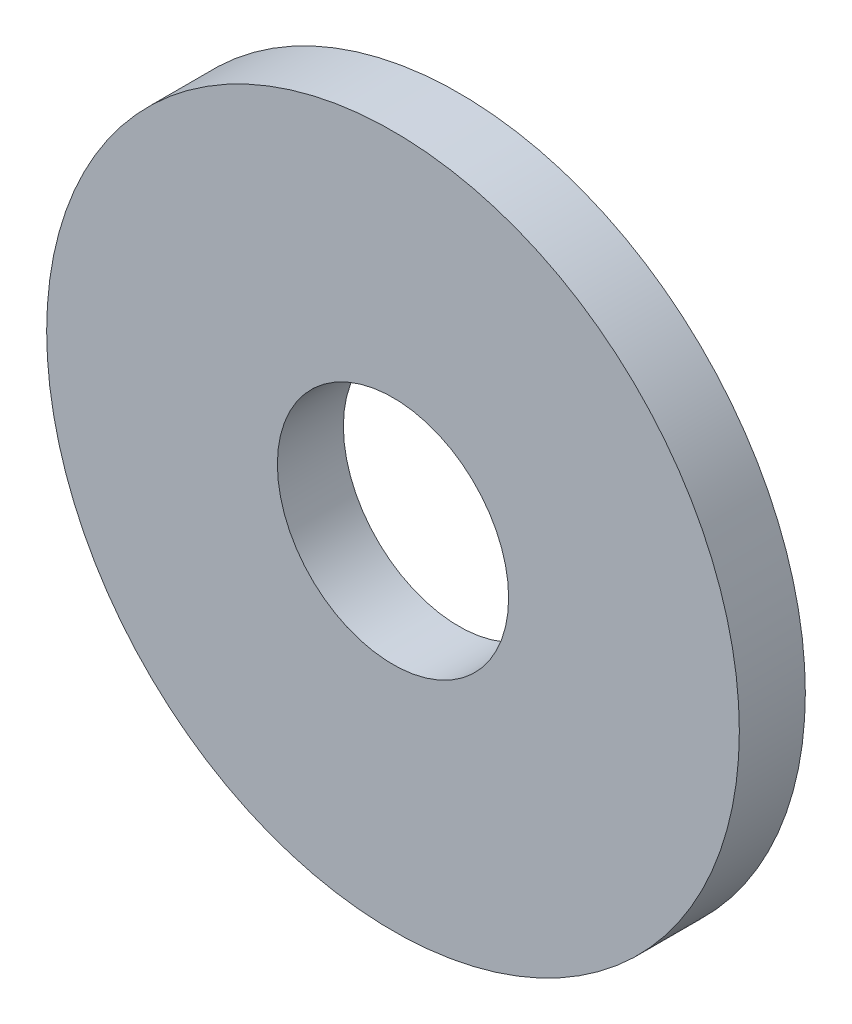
from build123d import *

# Parameters (mm, degrees)
SKETCH1_R           = 8.3312
SKETCH1_R_2         = 2.7813
BOSS_EXTRUDE1_DEPTH = 1.5875


with BuildPart() as part:
    # Sketch1 → Boss-Extrude1 (new body)
    with BuildSketch(Plane.XY):
        Circle(SKETCH1_R)
        Circle(SKETCH1_R_2, mode=Mode.SUBTRACT)
    extrude(amount=BOSS_EXTRUDE1_DEPTH)


solid = part.part
